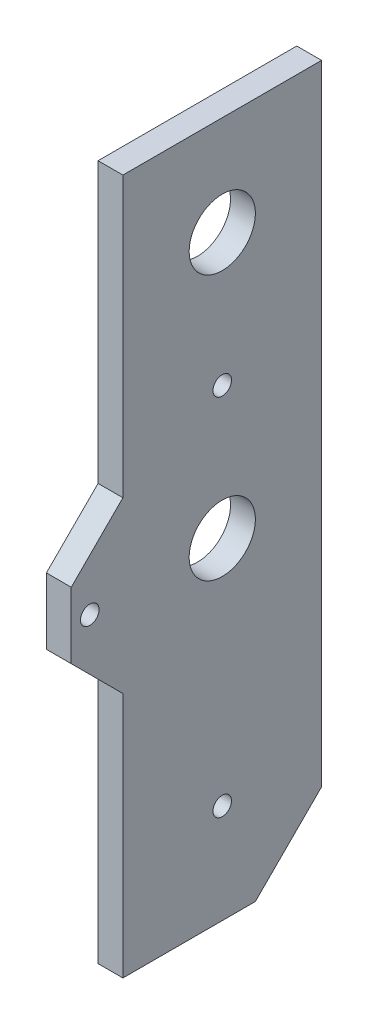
ISO-10303-21;
HEADER;
FILE_DESCRIPTION(('STEP AP214'),'2;1');
FILE_NAME('part.step','',(''),(''),'','','');
FILE_SCHEMA(('AUTOMOTIVE_DESIGN { 1 0 10303 214 1 1 1 1 }'));
ENDSEC;
DATA;
#1=APPLICATION_CONTEXT('core data for automotive mechanical design processes');
#2=APPLICATION_PROTOCOL_DEFINITION('international standard','automotive_design',2000,#1);
#3=PRODUCT_CONTEXT('',#1,'mechanical');
#4=PRODUCT('Part','Part','',(#3));
#5=PRODUCT_RELATED_PRODUCT_CATEGORY('part','',(#4));
#6=PRODUCT_DEFINITION_FORMATION('','',#4);
#7=PRODUCT_DEFINITION_CONTEXT('part definition',#1,'design');
#8=PRODUCT_DEFINITION('design','',#6,#7);
#9=PRODUCT_DEFINITION_SHAPE('','',#8);
#10=(LENGTH_UNIT() NAMED_UNIT(*) SI_UNIT(.MILLI.,.METRE.));
#11=(NAMED_UNIT(*) PLANE_ANGLE_UNIT() SI_UNIT($,.RADIAN.));
#12=(NAMED_UNIT(*) SI_UNIT($,.STERADIAN.) SOLID_ANGLE_UNIT());
#13=UNCERTAINTY_MEASURE_WITH_UNIT(LENGTH_MEASURE(1.E-05),#10,'distance_accuracy_value','');
#14=(GEOMETRIC_REPRESENTATION_CONTEXT(3) GLOBAL_UNCERTAINTY_ASSIGNED_CONTEXT((#13)) GLOBAL_UNIT_ASSIGNED_CONTEXT((#10,
#11,#12)) REPRESENTATION_CONTEXT('',''));
#15=CARTESIAN_POINT('',(0.,0.,0.));
#16=DIRECTION('',(0.,0.,1.));
#17=DIRECTION('',(1.,0.,0.));
#18=AXIS2_PLACEMENT_3D('',#15,#16,#17);
#19=CARTESIAN_POINT('',(4.7625,0.,0.));
#20=DIRECTION('',(1.,0.,0.));
#21=DIRECTION('',(0.,0.,-1.));
#22=AXIS2_PLACEMENT_3D('',#19,#20,#21);
#23=PLANE('',#22);
#24=CARTESIAN_POINT('',(4.7625,-1.97919458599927E-09,-2.22260629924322));
#25=DIRECTION('',(1.,0.,0.));
#26=DIRECTION('',(0.,0.,-1.));
#27=AXIS2_PLACEMENT_3D('',#24,#25,#26);
#28=CIRCLE('',#27,1.77799999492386);
#29=CARTESIAN_POINT('',(4.7625,-1.97919458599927E-09,-0.444606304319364));
#30=VERTEX_POINT('',#29);
#31=EDGE_CURVE('E214',#30,#30,#28,.T.);
#32=ORIENTED_EDGE('',*,*,#31,.F.);
#33=EDGE_LOOP('',(#32));
#34=FACE_BOUND('',#33,.T.);
#35=CARTESIAN_POINT('',(4.7625,50.7999999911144,-27.6226063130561));
#36=DIRECTION('',(1.,0.,0.));
#37=DIRECTION('',(0.,0.,-1.));
#38=AXIS2_PLACEMENT_3D('',#35,#36,#37);
#39=CIRCLE('',#38,6.34999999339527);
#40=CARTESIAN_POINT('',(4.7625,50.7999999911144,-21.2726063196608));
#41=VERTEX_POINT('',#40);
#42=EDGE_CURVE('E202',#41,#41,#39,.T.);
#43=ORIENTED_EDGE('',*,*,#42,.F.);
#44=EDGE_LOOP('',(#43));
#45=FACE_BOUND('',#44,.T.);
#46=DIRECTION('',(0.,-1.,2.71906559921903E-10));
#47=VECTOR('',#46,1.);
#48=CARTESIAN_POINT('',(4.7625,69.8499999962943,-8.57260631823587));
#49=LINE('',#48,#47);
#50=CARTESIAN_POINT('',(4.7625,69.8499999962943,-8.57260631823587));
#51=VERTEX_POINT('',#50);
#52=CARTESIAN_POINT('',(4.7625,16.2559999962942,-8.57260630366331));
#53=VERTEX_POINT('',#52);
#54=EDGE_CURVE('E157',#51,#53,#49,.T.);
#55=ORIENTED_EDGE('',*,*,#54,.T.);
#56=DIRECTION('',(0.,-0.70710678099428,0.707106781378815));
#57=VECTOR('',#56,1.);
#58=CARTESIAN_POINT('',(4.7625,16.2559999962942,-8.57260630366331));
#59=LINE('',#58,#57);
#60=CARTESIAN_POINT('',(4.7625,6.34999999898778,1.33339369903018));
#61=VERTEX_POINT('',#60);
#62=EDGE_CURVE('E100',#53,#61,#59,.T.);
#63=ORIENTED_EDGE('',*,*,#62,.T.);
#64=DIRECTION('',(0.,-1.,2.7190629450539E-10));
#65=VECTOR('',#64,1.);
#66=CARTESIAN_POINT('',(4.7625,6.34999999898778,1.33339369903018));
#67=LINE('',#66,#65);
#68=CARTESIAN_POINT('',(4.7625,-6.35000000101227,1.33339370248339));
#69=VERTEX_POINT('',#68);
#70=EDGE_CURVE('E175',#61,#69,#67,.T.);
#71=ORIENTED_EDGE('',*,*,#70,.T.);
#72=DIRECTION('',(0.,-0.707106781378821,-0.707106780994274));
#73=VECTOR('',#72,1.);
#74=CARTESIAN_POINT('',(4.7625,-6.35000000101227,1.33339370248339));
#75=LINE('',#74,#73);
#76=CARTESIAN_POINT('',(4.7625,-16.2560000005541,-8.57260629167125));
#77=VERTEX_POINT('',#76);
#78=EDGE_CURVE('E192',#69,#77,#75,.T.);
#79=ORIENTED_EDGE('',*,*,#78,.T.);
#80=DIRECTION('',(0.,-1.,2.60210834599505E-10));
#81=VECTOR('',#80,1.);
#82=CARTESIAN_POINT('',(4.7625,-63.5000000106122,-8.57260627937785));
#83=LINE('',#82,#81);
#84=CARTESIAN_POINT('',(4.7625,-63.5000000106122,-8.57260627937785));
#85=VERTEX_POINT('',#84);
#86=EDGE_CURVE('E191',#77,#85,#83,.T.);
#87=ORIENTED_EDGE('',*,*,#86,.T.);
#88=DIRECTION('',(0.,0.,-1.));
#89=VECTOR('',#88,1.);
#90=CARTESIAN_POINT('',(4.7625,-63.5000000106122,-8.57260627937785));
#91=LINE('',#90,#89);
#92=CARTESIAN_POINT('',(4.7625,-63.5000000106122,-33.9726062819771));
#93=VERTEX_POINT('',#92);
#94=EDGE_CURVE('E122',#85,#93,#91,.T.);
#95=ORIENTED_EDGE('',*,*,#94,.T.);
#96=DIRECTION('',(0.,0.70710678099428,-0.707106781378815));
#97=VECTOR('',#96,1.);
#98=CARTESIAN_POINT('',(4.7625,-50.8000000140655,-46.6726062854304));
#99=LINE('',#98,#97);
#100=CARTESIAN_POINT('',(4.7625,-50.8000000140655,-46.6726062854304));
#101=VERTEX_POINT('',#100);
#102=EDGE_CURVE('E116',#93,#101,#99,.T.);
#103=ORIENTED_EDGE('',*,*,#102,.T.);
#104=DIRECTION('',(0.,1.,-2.71906352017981E-10));
#105=VECTOR('',#104,1.);
#106=CARTESIAN_POINT('',(4.7625,69.8499999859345,-46.6726063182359));
#107=LINE('',#106,#105);
#108=CARTESIAN_POINT('',(4.7625,69.8499999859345,-46.6726063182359));
#109=VERTEX_POINT('',#108);
#110=EDGE_CURVE('E120',#101,#109,#107,.T.);
#111=ORIENTED_EDGE('',*,*,#110,.T.);
#112=DIRECTION('',(0.,2.71908479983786E-10,1.));
#113=VECTOR('',#112,1.);
#114=CARTESIAN_POINT('',(4.7625,69.8499999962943,-8.57260631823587));
#115=LINE('',#114,#113);
#116=EDGE_CURVE('E54',#109,#51,#115,.T.);
#117=ORIENTED_EDGE('',*,*,#116,.T.);
#118=EDGE_LOOP('',(#55,#63,#71,#79,#87,#95,#103,#111,#117));
#119=FACE_BOUND('',#118,.T.);
#120=CARTESIAN_POINT('',(4.7625,-8.88561446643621E-09,-27.6226062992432));
#121=DIRECTION('',(1.,0.,0.));
#122=DIRECTION('',(0.,0.,-1.));
#123=AXIS2_PLACEMENT_3D('',#120,#121,#122);
#124=CIRCLE('',#123,6.34999999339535);
#125=CARTESIAN_POINT('',(4.7625,-8.88561446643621E-09,-21.2726063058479));
#126=VERTEX_POINT('',#125);
#127=EDGE_CURVE('E144',#126,#126,#124,.T.);
#128=ORIENTED_EDGE('',*,*,#127,.F.);
#129=EDGE_LOOP('',(#128));
#130=FACE_BOUND('',#129,.T.);
#131=CARTESIAN_POINT('',(4.7625,-44.4500000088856,-27.622606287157));
#132=DIRECTION('',(1.,0.,0.));
#133=DIRECTION('',(0.,0.,-1.));
#134=AXIS2_PLACEMENT_3D('',#131,#132,#133);
#135=CIRCLE('',#134,1.77799999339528);
#136=CARTESIAN_POINT('',(4.7625,-44.4500000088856,-25.8446062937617));
#137=VERTEX_POINT('',#136);
#138=EDGE_CURVE('E208',#137,#137,#135,.T.);
#139=ORIENTED_EDGE('',*,*,#138,.F.);
#140=EDGE_LOOP('',(#139));
#141=FACE_BOUND('',#140,.T.);
#142=CARTESIAN_POINT('',(4.7625,25.3999999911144,-27.6226063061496));
#143=DIRECTION('',(1.,0.,0.));
#144=DIRECTION('',(0.,0.,-1.));
#145=AXIS2_PLACEMENT_3D('',#142,#143,#144);
#146=CIRCLE('',#145,1.77800000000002);
#147=CARTESIAN_POINT('',(4.7625,25.3999999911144,-25.8446063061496));
#148=VERTEX_POINT('',#147);
#149=EDGE_CURVE('E220',#148,#148,#146,.T.);
#150=ORIENTED_EDGE('',*,*,#149,.F.);
#151=EDGE_LOOP('',(#150));
#152=FACE_BOUND('',#151,.T.);
#153=ADVANCED_FACE('F37',(#34,#45,#119,#130,#141,#152),#23,.T.);
#154=CARTESIAN_POINT('',(0.,0.,0.));
#155=DIRECTION('',(1.,0.,0.));
#156=DIRECTION('',(0.,0.,-1.));
#157=AXIS2_PLACEMENT_3D('',#154,#155,#156);
#158=PLANE('',#157);
#159=DIRECTION('',(0.,-1.,2.71906559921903E-10));
#160=VECTOR('',#159,1.);
#161=CARTESIAN_POINT('',(0.,69.8499999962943,-8.57260631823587));
#162=LINE('',#161,#160);
#163=CARTESIAN_POINT('',(0.,69.8499999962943,-8.57260631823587));
#164=VERTEX_POINT('',#163);
#165=CARTESIAN_POINT('',(0.,16.2559999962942,-8.57260630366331));
#166=VERTEX_POINT('',#165);
#167=EDGE_CURVE('E140',#164,#166,#162,.T.);
#168=ORIENTED_EDGE('',*,*,#167,.F.);
#169=DIRECTION('',(0.,2.71908479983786E-10,1.));
#170=VECTOR('',#169,1.);
#171=CARTESIAN_POINT('',(0.,69.8499999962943,-8.57260631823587));
#172=LINE('',#171,#170);
#173=CARTESIAN_POINT('',(0.,69.8499999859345,-46.6726063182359));
#174=VERTEX_POINT('',#173);
#175=EDGE_CURVE('E92',#174,#164,#172,.T.);
#176=ORIENTED_EDGE('',*,*,#175,.F.);
#177=DIRECTION('',(0.,1.,-2.71906352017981E-10));
#178=VECTOR('',#177,1.);
#179=CARTESIAN_POINT('',(0.,69.8499999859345,-46.6726063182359));
#180=LINE('',#179,#178);
#181=CARTESIAN_POINT('',(0.,-50.8000000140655,-46.6726062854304));
#182=VERTEX_POINT('',#181);
#183=EDGE_CURVE('E86',#182,#174,#180,.T.);
#184=ORIENTED_EDGE('',*,*,#183,.F.);
#185=DIRECTION('',(0.,0.70710678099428,-0.707106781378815));
#186=VECTOR('',#185,1.);
#187=CARTESIAN_POINT('',(0.,-50.8000000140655,-46.6726062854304));
#188=LINE('',#187,#186);
#189=CARTESIAN_POINT('',(0.,-63.5000000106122,-33.9726062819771));
#190=VERTEX_POINT('',#189);
#191=EDGE_CURVE('E130',#190,#182,#188,.T.);
#192=ORIENTED_EDGE('',*,*,#191,.F.);
#193=DIRECTION('',(0.,0.,-1.));
#194=VECTOR('',#193,1.);
#195=CARTESIAN_POINT('',(0.,-63.5000000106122,-8.57260627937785));
#196=LINE('',#195,#194);
#197=CARTESIAN_POINT('',(0.,-63.5000000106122,-8.57260627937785));
#198=VERTEX_POINT('',#197);
#199=EDGE_CURVE('E152',#198,#190,#196,.T.);
#200=ORIENTED_EDGE('',*,*,#199,.F.);
#201=DIRECTION('',(0.,-1.,2.60210834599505E-10));
#202=VECTOR('',#201,1.);
#203=CARTESIAN_POINT('',(0.,-63.5000000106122,-8.57260627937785));
#204=LINE('',#203,#202);
#205=CARTESIAN_POINT('',(0.,-16.2560000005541,-8.57260629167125));
#206=VERTEX_POINT('',#205);
#207=EDGE_CURVE('E150',#206,#198,#204,.T.);
#208=ORIENTED_EDGE('',*,*,#207,.F.);
#209=DIRECTION('',(0.,-0.707106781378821,-0.707106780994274));
#210=VECTOR('',#209,1.);
#211=CARTESIAN_POINT('',(0.,-6.35000000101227,1.33339370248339));
#212=LINE('',#211,#210);
#213=CARTESIAN_POINT('',(0.,-6.35000000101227,1.33339370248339));
#214=VERTEX_POINT('',#213);
#215=EDGE_CURVE('E148',#214,#206,#212,.T.);
#216=ORIENTED_EDGE('',*,*,#215,.F.);
#217=DIRECTION('',(0.,-1.,2.7190629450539E-10));
#218=VECTOR('',#217,1.);
#219=CARTESIAN_POINT('',(0.,6.34999999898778,1.33339369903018));
#220=LINE('',#219,#218);
#221=CARTESIAN_POINT('',(0.,6.34999999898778,1.33339369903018));
#222=VERTEX_POINT('',#221);
#223=EDGE_CURVE('E146',#222,#214,#220,.T.);
#224=ORIENTED_EDGE('',*,*,#223,.F.);
#225=DIRECTION('',(0.,-0.70710678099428,0.707106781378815));
#226=VECTOR('',#225,1.);
#227=CARTESIAN_POINT('',(0.,16.2559999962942,-8.57260630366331));
#228=LINE('',#227,#226);
#229=EDGE_CURVE('E143',#166,#222,#228,.T.);
#230=ORIENTED_EDGE('',*,*,#229,.F.);
#231=EDGE_LOOP('',(#168,#176,#184,#192,#200,#208,#216,#224,#230));
#232=FACE_BOUND('',#231,.T.);
#233=CARTESIAN_POINT('',(0.,-8.88561446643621E-09,-27.6226062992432));
#234=DIRECTION('',(1.,0.,0.));
#235=DIRECTION('',(0.,0.,-1.));
#236=AXIS2_PLACEMENT_3D('',#233,#234,#235);
#237=CIRCLE('',#236,6.34999999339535);
#238=CARTESIAN_POINT('',(0.,-8.88561446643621E-09,-21.2726063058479));
#239=VERTEX_POINT('',#238);
#240=EDGE_CURVE('E199',#239,#239,#237,.T.);
#241=ORIENTED_EDGE('',*,*,#240,.T.);
#242=EDGE_LOOP('',(#241));
#243=FACE_BOUND('',#242,.T.);
#244=CARTESIAN_POINT('',(0.,50.7999999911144,-27.6226063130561));
#245=DIRECTION('',(1.,0.,0.));
#246=DIRECTION('',(0.,0.,-1.));
#247=AXIS2_PLACEMENT_3D('',#244,#245,#246);
#248=CIRCLE('',#247,6.34999999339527);
#249=CARTESIAN_POINT('',(0.,50.7999999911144,-21.2726063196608));
#250=VERTEX_POINT('',#249);
#251=EDGE_CURVE('E205',#250,#250,#248,.T.);
#252=ORIENTED_EDGE('',*,*,#251,.T.);
#253=EDGE_LOOP('',(#252));
#254=FACE_BOUND('',#253,.T.);
#255=CARTESIAN_POINT('',(0.,-44.4500000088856,-27.622606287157));
#256=DIRECTION('',(1.,0.,0.));
#257=DIRECTION('',(0.,0.,-1.));
#258=AXIS2_PLACEMENT_3D('',#255,#256,#257);
#259=CIRCLE('',#258,1.77799999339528);
#260=CARTESIAN_POINT('',(0.,-44.4500000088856,-25.8446062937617));
#261=VERTEX_POINT('',#260);
#262=EDGE_CURVE('E211',#261,#261,#259,.T.);
#263=ORIENTED_EDGE('',*,*,#262,.T.);
#264=EDGE_LOOP('',(#263));
#265=FACE_BOUND('',#264,.T.);
#266=CARTESIAN_POINT('',(0.,-1.97919458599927E-09,-2.22260629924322));
#267=DIRECTION('',(1.,0.,0.));
#268=DIRECTION('',(0.,0.,-1.));
#269=AXIS2_PLACEMENT_3D('',#266,#267,#268);
#270=CIRCLE('',#269,1.77799999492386);
#271=CARTESIAN_POINT('',(0.,-1.97919458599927E-09,-0.444606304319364));
#272=VERTEX_POINT('',#271);
#273=EDGE_CURVE('E217',#272,#272,#270,.T.);
#274=ORIENTED_EDGE('',*,*,#273,.T.);
#275=EDGE_LOOP('',(#274));
#276=FACE_BOUND('',#275,.T.);
#277=CARTESIAN_POINT('',(0.,25.3999999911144,-27.6226063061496));
#278=DIRECTION('',(1.,0.,0.));
#279=DIRECTION('',(0.,0.,-1.));
#280=AXIS2_PLACEMENT_3D('',#277,#278,#279);
#281=CIRCLE('',#280,1.77800000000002);
#282=CARTESIAN_POINT('',(0.,25.3999999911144,-25.8446063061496));
#283=VERTEX_POINT('',#282);
#284=EDGE_CURVE('E223',#283,#283,#281,.T.);
#285=ORIENTED_EDGE('',*,*,#284,.T.);
#286=EDGE_LOOP('',(#285));
#287=FACE_BOUND('',#286,.T.);
#288=ADVANCED_FACE('F179',(#232,#243,#254,#265,#276,#287),#158,.F.);
#289=CARTESIAN_POINT('',(4.7625,69.8499999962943,-8.57260631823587));
#290=DIRECTION('',(0.,-2.71906559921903E-10,-1.));
#291=DIRECTION('',(0.,1.,-2.71906559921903E-10));
#292=AXIS2_PLACEMENT_3D('',#289,#290,#291);
#293=PLANE('',#292);
#294=ORIENTED_EDGE('',*,*,#167,.T.);
#295=DIRECTION('',(-1.,0.,0.));
#296=VECTOR('',#295,1.);
#297=CARTESIAN_POINT('',(4.7625,16.2559999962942,-8.57260630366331));
#298=LINE('',#297,#296);
#299=EDGE_CURVE('E11',#53,#166,#298,.T.);
#300=ORIENTED_EDGE('',*,*,#299,.F.);
#301=ORIENTED_EDGE('',*,*,#54,.F.);
#302=DIRECTION('',(-1.,0.,0.));
#303=VECTOR('',#302,1.);
#304=CARTESIAN_POINT('',(4.7625,69.8499999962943,-8.57260631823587));
#305=LINE('',#304,#303);
#306=EDGE_CURVE('E136',#51,#164,#305,.T.);
#307=ORIENTED_EDGE('',*,*,#306,.T.);
#308=EDGE_LOOP('',(#294,#300,#301,#307));
#309=FACE_BOUND('',#308,.T.);
#310=ADVANCED_FACE('F39',(#309),#293,.F.);
#311=CARTESIAN_POINT('',(4.7625,16.2559999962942,-8.57260630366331));
#312=DIRECTION('',(0.,-0.707106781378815,-0.70710678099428));
#313=DIRECTION('',(0.,0.70710678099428,-0.707106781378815));
#314=AXIS2_PLACEMENT_3D('',#311,#312,#313);
#315=PLANE('',#314);
#316=ORIENTED_EDGE('',*,*,#229,.T.);
#317=DIRECTION('',(-1.,0.,0.));
#318=VECTOR('',#317,1.);
#319=CARTESIAN_POINT('',(4.7625,6.34999999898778,1.33339369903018));
#320=LINE('',#319,#318);
#321=EDGE_CURVE('E46',#61,#222,#320,.T.);
#322=ORIENTED_EDGE('',*,*,#321,.F.);
#323=ORIENTED_EDGE('',*,*,#62,.F.);
#324=ORIENTED_EDGE('',*,*,#299,.T.);
#325=EDGE_LOOP('',(#316,#322,#323,#324));
#326=FACE_BOUND('',#325,.T.);
#327=ADVANCED_FACE('F261',(#326),#315,.F.);
#328=CARTESIAN_POINT('',(4.7625,6.34999999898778,1.33339369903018));
#329=DIRECTION('',(0.,-2.71906294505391E-10,-1.));
#330=DIRECTION('',(0.,1.,-2.71906294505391E-10));
#331=AXIS2_PLACEMENT_3D('',#328,#329,#330);
#332=PLANE('',#331);
#333=ORIENTED_EDGE('',*,*,#223,.T.);
#334=DIRECTION('',(-1.,0.,0.));
#335=VECTOR('',#334,1.);
#336=CARTESIAN_POINT('',(4.7625,-6.35000000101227,1.33339370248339));
#337=LINE('',#336,#335);
#338=EDGE_CURVE('E167',#69,#214,#337,.T.);
#339=ORIENTED_EDGE('',*,*,#338,.F.);
#340=ORIENTED_EDGE('',*,*,#70,.F.);
#341=ORIENTED_EDGE('',*,*,#321,.T.);
#342=EDGE_LOOP('',(#333,#339,#340,#341));
#343=FACE_BOUND('',#342,.T.);
#344=ADVANCED_FACE('F173',(#343),#332,.F.);
#345=CARTESIAN_POINT('',(4.7625,-6.35000000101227,1.33339370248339));
#346=DIRECTION('',(0.,0.707106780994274,-0.707106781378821));
#347=DIRECTION('',(0.,0.707106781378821,0.707106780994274));
#348=AXIS2_PLACEMENT_3D('',#345,#346,#347);
#349=PLANE('',#348);
#350=ORIENTED_EDGE('',*,*,#215,.T.);
#351=DIRECTION('',(-1.,0.,0.));
#352=VECTOR('',#351,1.);
#353=CARTESIAN_POINT('',(4.7625,-16.2560000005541,-8.57260629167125));
#354=LINE('',#353,#352);
#355=EDGE_CURVE('E164',#77,#206,#354,.T.);
#356=ORIENTED_EDGE('',*,*,#355,.F.);
#357=ORIENTED_EDGE('',*,*,#78,.F.);
#358=ORIENTED_EDGE('',*,*,#338,.T.);
#359=EDGE_LOOP('',(#350,#356,#357,#358));
#360=FACE_BOUND('',#359,.T.);
#361=ADVANCED_FACE('F185',(#360),#349,.F.);
#362=CARTESIAN_POINT('',(4.7625,-63.5000000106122,-8.57260627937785));
#363=DIRECTION('',(0.,-2.60210834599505E-10,-1.));
#364=DIRECTION('',(0.,1.,-2.60210834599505E-10));
#365=AXIS2_PLACEMENT_3D('',#362,#363,#364);
#366=PLANE('',#365);
#367=ORIENTED_EDGE('',*,*,#207,.T.);
#368=DIRECTION('',(-1.,0.,0.));
#369=VECTOR('',#368,1.);
#370=CARTESIAN_POINT('',(4.7625,-63.5000000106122,-8.57260627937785));
#371=LINE('',#370,#369);
#372=EDGE_CURVE('E161',#85,#198,#371,.T.);
#373=ORIENTED_EDGE('',*,*,#372,.F.);
#374=ORIENTED_EDGE('',*,*,#86,.F.);
#375=ORIENTED_EDGE('',*,*,#355,.T.);
#376=EDGE_LOOP('',(#367,#373,#374,#375));
#377=FACE_BOUND('',#376,.T.);
#378=ADVANCED_FACE('F189',(#377),#366,.F.);
#379=CARTESIAN_POINT('',(4.7625,-63.5000000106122,-8.57260627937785));
#380=DIRECTION('',(0.,1.,0.));
#381=DIRECTION('',(0.,0.,1.));
#382=AXIS2_PLACEMENT_3D('',#379,#380,#381);
#383=PLANE('',#382);
#384=ORIENTED_EDGE('',*,*,#199,.T.);
#385=DIRECTION('',(-1.,0.,0.));
#386=VECTOR('',#385,1.);
#387=CARTESIAN_POINT('',(4.7625,-63.5000000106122,-33.9726062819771));
#388=LINE('',#387,#386);
#389=EDGE_CURVE('E131',#93,#190,#388,.T.);
#390=ORIENTED_EDGE('',*,*,#389,.F.);
#391=ORIENTED_EDGE('',*,*,#94,.F.);
#392=ORIENTED_EDGE('',*,*,#372,.T.);
#393=EDGE_LOOP('',(#384,#390,#391,#392));
#394=FACE_BOUND('',#393,.T.);
#395=ADVANCED_FACE('F252',(#394),#383,.F.);
#396=CARTESIAN_POINT('',(4.7625,-50.8000000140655,-46.6726062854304));
#397=DIRECTION('',(0.,0.707106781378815,0.70710678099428));
#398=DIRECTION('',(0.,-0.70710678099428,0.707106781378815));
#399=AXIS2_PLACEMENT_3D('',#396,#397,#398);
#400=PLANE('',#399);
#401=ORIENTED_EDGE('',*,*,#191,.T.);
#402=DIRECTION('',(-1.,0.,0.));
#403=VECTOR('',#402,1.);
#404=CARTESIAN_POINT('',(4.7625,-50.8000000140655,-46.6726062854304));
#405=LINE('',#404,#403);
#406=EDGE_CURVE('E127',#101,#182,#405,.T.);
#407=ORIENTED_EDGE('',*,*,#406,.F.);
#408=ORIENTED_EDGE('',*,*,#102,.F.);
#409=ORIENTED_EDGE('',*,*,#389,.T.);
#410=EDGE_LOOP('',(#401,#407,#408,#409));
#411=FACE_BOUND('',#410,.T.);
#412=ADVANCED_FACE('F128',(#411),#400,.F.);
#413=CARTESIAN_POINT('',(4.7625,69.8499999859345,-46.6726063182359));
#414=DIRECTION('',(0.,2.71906352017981E-10,1.));
#415=DIRECTION('',(0.,-1.,2.71906352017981E-10));
#416=AXIS2_PLACEMENT_3D('',#413,#414,#415);
#417=PLANE('',#416);
#418=ORIENTED_EDGE('',*,*,#183,.T.);
#419=DIRECTION('',(-1.,0.,0.));
#420=VECTOR('',#419,1.);
#421=CARTESIAN_POINT('',(4.7625,69.8499999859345,-46.6726063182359));
#422=LINE('',#421,#420);
#423=EDGE_CURVE('E132',#109,#174,#422,.T.);
#424=ORIENTED_EDGE('',*,*,#423,.F.);
#425=ORIENTED_EDGE('',*,*,#110,.F.);
#426=ORIENTED_EDGE('',*,*,#406,.T.);
#427=EDGE_LOOP('',(#418,#424,#425,#426));
#428=FACE_BOUND('',#427,.T.);
#429=ADVANCED_FACE('F134',(#428),#417,.F.);
#430=CARTESIAN_POINT('',(4.7625,69.8499999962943,-8.57260631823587));
#431=DIRECTION('',(0.,-1.,2.71908479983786E-10));
#432=DIRECTION('',(0.,-2.71908479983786E-10,-1.));
#433=AXIS2_PLACEMENT_3D('',#430,#431,#432);
#434=PLANE('',#433);
#435=ORIENTED_EDGE('',*,*,#175,.T.);
#436=ORIENTED_EDGE('',*,*,#306,.F.);
#437=ORIENTED_EDGE('',*,*,#116,.F.);
#438=ORIENTED_EDGE('',*,*,#423,.T.);
#439=EDGE_LOOP('',(#435,#436,#437,#438));
#440=FACE_BOUND('',#439,.T.);
#441=ADVANCED_FACE('F245',(#440),#434,.F.);
#442=CARTESIAN_POINT('',(4.7625,-8.88561446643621E-09,-27.6226062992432));
#443=DIRECTION('',(-1.,0.,0.));
#444=DIRECTION('',(0.,0.,1.));
#445=AXIS2_PLACEMENT_3D('',#442,#443,#444);
#446=CYLINDRICAL_SURFACE('',#445,6.34999999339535);
#447=CARTESIAN_POINT('',(4.7625,-8.88561446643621E-09,-21.2726063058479));
#448=CARTESIAN_POINT('',(4.712890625,-8.88561446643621E-09,-21.2726063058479));
#449=CARTESIAN_POINT('',(4.66328125,-8.88561446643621E-09,-21.2726063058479));
#450=CARTESIAN_POINT('',(4.5640625,-8.88561446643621E-09,-21.2726063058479));
#451=CARTESIAN_POINT('',(4.514453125,-8.88561446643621E-09,-21.2726063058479));
#452=CARTESIAN_POINT('',(4.415234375,-8.88561446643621E-09,-21.2726063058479));
#453=CARTESIAN_POINT('',(4.365625,-8.88561446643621E-09,-21.2726063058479));
#454=CARTESIAN_POINT('',(4.26640625,-8.88561446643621E-09,-21.2726063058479));
#455=CARTESIAN_POINT('',(4.216796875,-8.88561446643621E-09,-21.2726063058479));
#456=CARTESIAN_POINT('',(4.117578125,-8.88561446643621E-09,-21.2726063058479));
#457=CARTESIAN_POINT('',(4.06796875,-8.88561446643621E-09,-21.2726063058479));
#458=CARTESIAN_POINT('',(3.96875,-8.88561446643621E-09,-21.2726063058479));
#459=CARTESIAN_POINT('',(3.919140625,-8.88561446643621E-09,-21.2726063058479));
#460=CARTESIAN_POINT('',(3.819921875,-8.88561446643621E-09,-21.2726063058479));
#461=CARTESIAN_POINT('',(3.7703125,-8.88561446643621E-09,-21.2726063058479));
#462=CARTESIAN_POINT('',(3.67109375,-8.88561446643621E-09,-21.2726063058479));
#463=CARTESIAN_POINT('',(3.621484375,-8.88561446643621E-09,-21.2726063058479));
#464=CARTESIAN_POINT('',(3.522265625,-8.88561446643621E-09,-21.2726063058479));
#465=CARTESIAN_POINT('',(3.47265625,-8.88561446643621E-09,-21.2726063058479));
#466=CARTESIAN_POINT('',(3.3734375,-8.88561446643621E-09,-21.2726063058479));
#467=CARTESIAN_POINT('',(3.323828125,-8.88561446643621E-09,-21.2726063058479));
#468=CARTESIAN_POINT('',(3.224609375,-8.88561446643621E-09,-21.2726063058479));
#469=CARTESIAN_POINT('',(3.175,-8.88561446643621E-09,-21.2726063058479));
#470=CARTESIAN_POINT('',(3.07578125,-8.88561446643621E-09,-21.2726063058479));
#471=CARTESIAN_POINT('',(3.026171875,-8.88561446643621E-09,-21.2726063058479));
#472=CARTESIAN_POINT('',(2.926953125,-8.88561446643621E-09,-21.2726063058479));
#473=CARTESIAN_POINT('',(2.87734375,-8.88561446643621E-09,-21.2726063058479));
#474=CARTESIAN_POINT('',(2.778125,-8.88561446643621E-09,-21.2726063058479));
#475=CARTESIAN_POINT('',(2.728515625,-8.88561446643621E-09,-21.2726063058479));
#476=CARTESIAN_POINT('',(2.629296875,-8.88561446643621E-09,-21.2726063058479));
#477=CARTESIAN_POINT('',(2.5796875,-8.88561446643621E-09,-21.2726063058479));
#478=CARTESIAN_POINT('',(2.48046875,-8.88561446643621E-09,-21.2726063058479));
#479=CARTESIAN_POINT('',(2.430859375,-8.88561446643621E-09,-21.2726063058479));
#480=CARTESIAN_POINT('',(2.331640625,-8.88561446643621E-09,-21.2726063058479));
#481=CARTESIAN_POINT('',(2.28203125,-8.88561446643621E-09,-21.2726063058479));
#482=CARTESIAN_POINT('',(2.1828125,-8.88561446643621E-09,-21.2726063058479));
#483=CARTESIAN_POINT('',(2.133203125,-8.88561446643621E-09,-21.2726063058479));
#484=CARTESIAN_POINT('',(2.033984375,-8.88561446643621E-09,-21.2726063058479));
#485=CARTESIAN_POINT('',(1.984375,-8.88561446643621E-09,-21.2726063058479));
#486=CARTESIAN_POINT('',(1.88515625,-8.88561446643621E-09,-21.2726063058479));
#487=CARTESIAN_POINT('',(1.835546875,-8.88561446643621E-09,-21.2726063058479));
#488=CARTESIAN_POINT('',(1.736328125,-8.88561446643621E-09,-21.2726063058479));
#489=CARTESIAN_POINT('',(1.68671875,-8.88561446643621E-09,-21.2726063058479));
#490=CARTESIAN_POINT('',(1.5875,-8.88561446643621E-09,-21.2726063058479));
#491=CARTESIAN_POINT('',(1.537890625,-8.88561446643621E-09,-21.2726063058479));
#492=CARTESIAN_POINT('',(1.438671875,-8.88561446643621E-09,-21.2726063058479));
#493=CARTESIAN_POINT('',(1.3890625,-8.88561446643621E-09,-21.2726063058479));
#494=CARTESIAN_POINT('',(1.28984375,-8.88561446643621E-09,-21.2726063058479));
#495=CARTESIAN_POINT('',(1.240234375,-8.88561446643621E-09,-21.2726063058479));
#496=CARTESIAN_POINT('',(1.141015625,-8.88561446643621E-09,-21.2726063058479));
#497=CARTESIAN_POINT('',(1.09140625,-8.88561446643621E-09,-21.2726063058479));
#498=CARTESIAN_POINT('',(0.992187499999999,-8.88561446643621E-09,-21.2726063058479));
#499=CARTESIAN_POINT('',(0.942578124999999,-8.88561446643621E-09,-21.2726063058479));
#500=CARTESIAN_POINT('',(0.843359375,-8.88561446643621E-09,-21.2726063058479));
#501=CARTESIAN_POINT('',(0.79375,-8.88561446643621E-09,-21.2726063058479));
#502=CARTESIAN_POINT('',(0.69453125,-8.88561446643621E-09,-21.2726063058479));
#503=CARTESIAN_POINT('',(0.644921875,-8.88561446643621E-09,-21.2726063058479));
#504=CARTESIAN_POINT('',(0.545703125,-8.88561446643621E-09,-21.2726063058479));
#505=CARTESIAN_POINT('',(0.49609375,-8.88561446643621E-09,-21.2726063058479));
#506=CARTESIAN_POINT('',(0.396875,-8.88561446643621E-09,-21.2726063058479));
#507=CARTESIAN_POINT('',(0.347265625,-8.88561446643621E-09,-21.2726063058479));
#508=CARTESIAN_POINT('',(0.248046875,-8.88561446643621E-09,-21.2726063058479));
#509=CARTESIAN_POINT('',(0.1984375,-8.88561446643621E-09,-21.2726063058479));
#510=CARTESIAN_POINT('',(0.09921875,-8.88561446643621E-09,-21.2726063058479));
#511=CARTESIAN_POINT('',(0.049609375,-8.88561446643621E-09,-21.2726063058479));
#512=CARTESIAN_POINT('',(0.,-8.88561446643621E-09,-21.2726063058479));
#513=B_SPLINE_CURVE_WITH_KNOTS('',3,(#447,#448,#449,#450,#451,#452,#453,#454,#455,#456,#457,
#458,#459,#460,#461,#462,#463,#464,#465,#466,#467,#468,#469,#470,#471,#472,#473,#474,#475,#476,
#477,#478,#479,#480,#481,#482,#483,#484,#485,#486,#487,#488,#489,#490,#491,#492,#493,#494,#495,
#496,#497,#498,#499,#500,#501,#502,#503,#504,#505,#506,#507,#508,#509,#510,#511,#512),
.UNSPECIFIED.,.F.,.F.,(4,2,2,2,2,2,2,2,2,2,2,2,2,2,2,2,2,2,2,2,2,2,2,2,2,2,2,2,2,2,2,2,4),(0.,
0.148828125,0.29765625,0.446484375,0.5953125,0.744140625,0.892968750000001,1.041796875,1.190625,
1.339453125,1.48828125,1.637109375,1.7859375,1.934765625,2.08359375,2.232421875,2.38125,
2.530078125,2.67890625,2.827734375,2.9765625,3.125390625,3.27421875,3.423046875,3.571875,
3.720703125,3.86953125,4.018359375,4.1671875,4.316015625,4.46484375,4.613671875,4.7625),.UNSPECIFIED.);
#514=EDGE_CURVE('BSEAM242',#126,#239,#513,.T.);
#515=ORIENTED_EDGE('',*,*,#127,.T.);
#516=ORIENTED_EDGE('',*,*,#240,.F.);
#517=ORIENTED_EDGE('',*,*,#514,.T.);
#518=ORIENTED_EDGE('',*,*,#514,.F.);
#519=EDGE_LOOP('',(#515,#517,#516,#518));
#520=FACE_BOUND('',#519,.T.);
#521=ADVANCED_FACE('F242',(#520),#446,.F.);
#522=CARTESIAN_POINT('',(4.7625,50.7999999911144,-27.6226063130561));
#523=DIRECTION('',(-1.,0.,0.));
#524=DIRECTION('',(0.,0.,1.));
#525=AXIS2_PLACEMENT_3D('',#522,#523,#524);
#526=CYLINDRICAL_SURFACE('',#525,6.34999999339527);
#527=CARTESIAN_POINT('',(4.7625,50.7999999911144,-21.2726063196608));
#528=CARTESIAN_POINT('',(4.712890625,50.7999999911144,-21.2726063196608));
#529=CARTESIAN_POINT('',(4.66328125,50.7999999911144,-21.2726063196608));
#530=CARTESIAN_POINT('',(4.5640625,50.7999999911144,-21.2726063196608));
#531=CARTESIAN_POINT('',(4.514453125,50.7999999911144,-21.2726063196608));
#532=CARTESIAN_POINT('',(4.415234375,50.7999999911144,-21.2726063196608));
#533=CARTESIAN_POINT('',(4.365625,50.7999999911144,-21.2726063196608));
#534=CARTESIAN_POINT('',(4.26640625,50.7999999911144,-21.2726063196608));
#535=CARTESIAN_POINT('',(4.216796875,50.7999999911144,-21.2726063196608));
#536=CARTESIAN_POINT('',(4.117578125,50.7999999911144,-21.2726063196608));
#537=CARTESIAN_POINT('',(4.06796875,50.7999999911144,-21.2726063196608));
#538=CARTESIAN_POINT('',(3.96875,50.7999999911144,-21.2726063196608));
#539=CARTESIAN_POINT('',(3.919140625,50.7999999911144,-21.2726063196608));
#540=CARTESIAN_POINT('',(3.819921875,50.7999999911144,-21.2726063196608));
#541=CARTESIAN_POINT('',(3.7703125,50.7999999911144,-21.2726063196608));
#542=CARTESIAN_POINT('',(3.67109375,50.7999999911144,-21.2726063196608));
#543=CARTESIAN_POINT('',(3.621484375,50.7999999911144,-21.2726063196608));
#544=CARTESIAN_POINT('',(3.522265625,50.7999999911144,-21.2726063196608));
#545=CARTESIAN_POINT('',(3.47265625,50.7999999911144,-21.2726063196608));
#546=CARTESIAN_POINT('',(3.3734375,50.7999999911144,-21.2726063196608));
#547=CARTESIAN_POINT('',(3.323828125,50.7999999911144,-21.2726063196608));
#548=CARTESIAN_POINT('',(3.224609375,50.7999999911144,-21.2726063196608));
#549=CARTESIAN_POINT('',(3.175,50.7999999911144,-21.2726063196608));
#550=CARTESIAN_POINT('',(3.07578125,50.7999999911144,-21.2726063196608));
#551=CARTESIAN_POINT('',(3.026171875,50.7999999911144,-21.2726063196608));
#552=CARTESIAN_POINT('',(2.926953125,50.7999999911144,-21.2726063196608));
#553=CARTESIAN_POINT('',(2.87734375,50.7999999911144,-21.2726063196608));
#554=CARTESIAN_POINT('',(2.778125,50.7999999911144,-21.2726063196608));
#555=CARTESIAN_POINT('',(2.728515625,50.7999999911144,-21.2726063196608));
#556=CARTESIAN_POINT('',(2.629296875,50.7999999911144,-21.2726063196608));
#557=CARTESIAN_POINT('',(2.5796875,50.7999999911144,-21.2726063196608));
#558=CARTESIAN_POINT('',(2.48046875,50.7999999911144,-21.2726063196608));
#559=CARTESIAN_POINT('',(2.430859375,50.7999999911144,-21.2726063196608));
#560=CARTESIAN_POINT('',(2.331640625,50.7999999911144,-21.2726063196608));
#561=CARTESIAN_POINT('',(2.28203125,50.7999999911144,-21.2726063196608));
#562=CARTESIAN_POINT('',(2.1828125,50.7999999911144,-21.2726063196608));
#563=CARTESIAN_POINT('',(2.133203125,50.7999999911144,-21.2726063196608));
#564=CARTESIAN_POINT('',(2.033984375,50.7999999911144,-21.2726063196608));
#565=CARTESIAN_POINT('',(1.984375,50.7999999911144,-21.2726063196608));
#566=CARTESIAN_POINT('',(1.88515625,50.7999999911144,-21.2726063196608));
#567=CARTESIAN_POINT('',(1.835546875,50.7999999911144,-21.2726063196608));
#568=CARTESIAN_POINT('',(1.736328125,50.7999999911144,-21.2726063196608));
#569=CARTESIAN_POINT('',(1.68671875,50.7999999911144,-21.2726063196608));
#570=CARTESIAN_POINT('',(1.5875,50.7999999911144,-21.2726063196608));
#571=CARTESIAN_POINT('',(1.537890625,50.7999999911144,-21.2726063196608));
#572=CARTESIAN_POINT('',(1.438671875,50.7999999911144,-21.2726063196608));
#573=CARTESIAN_POINT('',(1.3890625,50.7999999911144,-21.2726063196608));
#574=CARTESIAN_POINT('',(1.28984375,50.7999999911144,-21.2726063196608));
#575=CARTESIAN_POINT('',(1.240234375,50.7999999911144,-21.2726063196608));
#576=CARTESIAN_POINT('',(1.141015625,50.7999999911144,-21.2726063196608));
#577=CARTESIAN_POINT('',(1.09140625,50.7999999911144,-21.2726063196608));
#578=CARTESIAN_POINT('',(0.992187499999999,50.7999999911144,-21.2726063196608));
#579=CARTESIAN_POINT('',(0.942578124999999,50.7999999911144,-21.2726063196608));
#580=CARTESIAN_POINT('',(0.843359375,50.7999999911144,-21.2726063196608));
#581=CARTESIAN_POINT('',(0.79375,50.7999999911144,-21.2726063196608));
#582=CARTESIAN_POINT('',(0.69453125,50.7999999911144,-21.2726063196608));
#583=CARTESIAN_POINT('',(0.644921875,50.7999999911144,-21.2726063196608));
#584=CARTESIAN_POINT('',(0.545703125,50.7999999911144,-21.2726063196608));
#585=CARTESIAN_POINT('',(0.49609375,50.7999999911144,-21.2726063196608));
#586=CARTESIAN_POINT('',(0.396875,50.7999999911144,-21.2726063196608));
#587=CARTESIAN_POINT('',(0.347265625,50.7999999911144,-21.2726063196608));
#588=CARTESIAN_POINT('',(0.248046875,50.7999999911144,-21.2726063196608));
#589=CARTESIAN_POINT('',(0.1984375,50.7999999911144,-21.2726063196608));
#590=CARTESIAN_POINT('',(0.09921875,50.7999999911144,-21.2726063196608));
#591=CARTESIAN_POINT('',(0.049609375,50.7999999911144,-21.2726063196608));
#592=CARTESIAN_POINT('',(0.,50.7999999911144,-21.2726063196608));
#593=B_SPLINE_CURVE_WITH_KNOTS('',3,(#527,#528,#529,#530,#531,#532,#533,#534,#535,#536,#537,
#538,#539,#540,#541,#542,#543,#544,#545,#546,#547,#548,#549,#550,#551,#552,#553,#554,#555,#556,
#557,#558,#559,#560,#561,#562,#563,#564,#565,#566,#567,#568,#569,#570,#571,#572,#573,#574,#575,
#576,#577,#578,#579,#580,#581,#582,#583,#584,#585,#586,#587,#588,#589,#590,#591,#592),
.UNSPECIFIED.,.F.,.F.,(4,2,2,2,2,2,2,2,2,2,2,2,2,2,2,2,2,2,2,2,2,2,2,2,2,2,2,2,2,2,2,2,4),(0.,
0.148828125,0.29765625,0.446484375,0.5953125,0.744140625,0.892968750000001,1.041796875,1.190625,
1.339453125,1.48828125,1.637109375,1.7859375,1.934765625,2.08359375,2.232421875,2.38125,
2.530078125,2.67890625,2.827734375,2.9765625,3.125390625,3.27421875,3.423046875,3.571875,
3.720703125,3.86953125,4.018359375,4.1671875,4.316015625,4.46484375,4.613671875,4.7625),.UNSPECIFIED.);
#594=EDGE_CURVE('BSEAM330',#41,#250,#593,.T.);
#595=ORIENTED_EDGE('',*,*,#42,.T.);
#596=ORIENTED_EDGE('',*,*,#251,.F.);
#597=ORIENTED_EDGE('',*,*,#594,.T.);
#598=ORIENTED_EDGE('',*,*,#594,.F.);
#599=EDGE_LOOP('',(#595,#597,#596,#598));
#600=FACE_BOUND('',#599,.T.);
#601=ADVANCED_FACE('F330',(#600),#526,.F.);
#602=CARTESIAN_POINT('',(4.7625,-44.4500000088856,-27.622606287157));
#603=DIRECTION('',(-1.,0.,0.));
#604=DIRECTION('',(0.,0.,1.));
#605=AXIS2_PLACEMENT_3D('',#602,#603,#604);
#606=CYLINDRICAL_SURFACE('',#605,1.77799999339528);
#607=CARTESIAN_POINT('',(4.7625,-44.4500000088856,-25.8446062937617));
#608=CARTESIAN_POINT('',(4.712890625,-44.4500000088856,-25.8446062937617));
#609=CARTESIAN_POINT('',(4.66328125,-44.4500000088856,-25.8446062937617));
#610=CARTESIAN_POINT('',(4.5640625,-44.4500000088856,-25.8446062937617));
#611=CARTESIAN_POINT('',(4.514453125,-44.4500000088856,-25.8446062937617));
#612=CARTESIAN_POINT('',(4.415234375,-44.4500000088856,-25.8446062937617));
#613=CARTESIAN_POINT('',(4.365625,-44.4500000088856,-25.8446062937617));
#614=CARTESIAN_POINT('',(4.26640625,-44.4500000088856,-25.8446062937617));
#615=CARTESIAN_POINT('',(4.216796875,-44.4500000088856,-25.8446062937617));
#616=CARTESIAN_POINT('',(4.117578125,-44.4500000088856,-25.8446062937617));
#617=CARTESIAN_POINT('',(4.06796875,-44.4500000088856,-25.8446062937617));
#618=CARTESIAN_POINT('',(3.96875,-44.4500000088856,-25.8446062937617));
#619=CARTESIAN_POINT('',(3.919140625,-44.4500000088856,-25.8446062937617));
#620=CARTESIAN_POINT('',(3.819921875,-44.4500000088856,-25.8446062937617));
#621=CARTESIAN_POINT('',(3.7703125,-44.4500000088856,-25.8446062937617));
#622=CARTESIAN_POINT('',(3.67109375,-44.4500000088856,-25.8446062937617));
#623=CARTESIAN_POINT('',(3.621484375,-44.4500000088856,-25.8446062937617));
#624=CARTESIAN_POINT('',(3.522265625,-44.4500000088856,-25.8446062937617));
#625=CARTESIAN_POINT('',(3.47265625,-44.4500000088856,-25.8446062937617));
#626=CARTESIAN_POINT('',(3.3734375,-44.4500000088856,-25.8446062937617));
#627=CARTESIAN_POINT('',(3.323828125,-44.4500000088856,-25.8446062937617));
#628=CARTESIAN_POINT('',(3.224609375,-44.4500000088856,-25.8446062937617));
#629=CARTESIAN_POINT('',(3.175,-44.4500000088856,-25.8446062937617));
#630=CARTESIAN_POINT('',(3.07578125,-44.4500000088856,-25.8446062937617));
#631=CARTESIAN_POINT('',(3.026171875,-44.4500000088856,-25.8446062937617));
#632=CARTESIAN_POINT('',(2.926953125,-44.4500000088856,-25.8446062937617));
#633=CARTESIAN_POINT('',(2.87734375,-44.4500000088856,-25.8446062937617));
#634=CARTESIAN_POINT('',(2.778125,-44.4500000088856,-25.8446062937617));
#635=CARTESIAN_POINT('',(2.728515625,-44.4500000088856,-25.8446062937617));
#636=CARTESIAN_POINT('',(2.629296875,-44.4500000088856,-25.8446062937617));
#637=CARTESIAN_POINT('',(2.5796875,-44.4500000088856,-25.8446062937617));
#638=CARTESIAN_POINT('',(2.48046875,-44.4500000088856,-25.8446062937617));
#639=CARTESIAN_POINT('',(2.430859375,-44.4500000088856,-25.8446062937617));
#640=CARTESIAN_POINT('',(2.331640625,-44.4500000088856,-25.8446062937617));
#641=CARTESIAN_POINT('',(2.28203125,-44.4500000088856,-25.8446062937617));
#642=CARTESIAN_POINT('',(2.1828125,-44.4500000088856,-25.8446062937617));
#643=CARTESIAN_POINT('',(2.133203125,-44.4500000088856,-25.8446062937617));
#644=CARTESIAN_POINT('',(2.033984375,-44.4500000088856,-25.8446062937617));
#645=CARTESIAN_POINT('',(1.984375,-44.4500000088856,-25.8446062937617));
#646=CARTESIAN_POINT('',(1.88515625,-44.4500000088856,-25.8446062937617));
#647=CARTESIAN_POINT('',(1.835546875,-44.4500000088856,-25.8446062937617));
#648=CARTESIAN_POINT('',(1.736328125,-44.4500000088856,-25.8446062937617));
#649=CARTESIAN_POINT('',(1.68671875,-44.4500000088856,-25.8446062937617));
#650=CARTESIAN_POINT('',(1.5875,-44.4500000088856,-25.8446062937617));
#651=CARTESIAN_POINT('',(1.537890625,-44.4500000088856,-25.8446062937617));
#652=CARTESIAN_POINT('',(1.438671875,-44.4500000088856,-25.8446062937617));
#653=CARTESIAN_POINT('',(1.3890625,-44.4500000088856,-25.8446062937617));
#654=CARTESIAN_POINT('',(1.28984375,-44.4500000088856,-25.8446062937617));
#655=CARTESIAN_POINT('',(1.240234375,-44.4500000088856,-25.8446062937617));
#656=CARTESIAN_POINT('',(1.141015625,-44.4500000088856,-25.8446062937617));
#657=CARTESIAN_POINT('',(1.09140625,-44.4500000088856,-25.8446062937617));
#658=CARTESIAN_POINT('',(0.992187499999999,-44.4500000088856,-25.8446062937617));
#659=CARTESIAN_POINT('',(0.942578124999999,-44.4500000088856,-25.8446062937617));
#660=CARTESIAN_POINT('',(0.843359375,-44.4500000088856,-25.8446062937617));
#661=CARTESIAN_POINT('',(0.79375,-44.4500000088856,-25.8446062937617));
#662=CARTESIAN_POINT('',(0.69453125,-44.4500000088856,-25.8446062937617));
#663=CARTESIAN_POINT('',(0.644921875,-44.4500000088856,-25.8446062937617));
#664=CARTESIAN_POINT('',(0.545703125,-44.4500000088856,-25.8446062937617));
#665=CARTESIAN_POINT('',(0.49609375,-44.4500000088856,-25.8446062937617));
#666=CARTESIAN_POINT('',(0.396875,-44.4500000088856,-25.8446062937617));
#667=CARTESIAN_POINT('',(0.347265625,-44.4500000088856,-25.8446062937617));
#668=CARTESIAN_POINT('',(0.248046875,-44.4500000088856,-25.8446062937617));
#669=CARTESIAN_POINT('',(0.1984375,-44.4500000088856,-25.8446062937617));
#670=CARTESIAN_POINT('',(0.09921875,-44.4500000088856,-25.8446062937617));
#671=CARTESIAN_POINT('',(0.049609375,-44.4500000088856,-25.8446062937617));
#672=CARTESIAN_POINT('',(0.,-44.4500000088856,-25.8446062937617));
#673=B_SPLINE_CURVE_WITH_KNOTS('',3,(#607,#608,#609,#610,#611,#612,#613,#614,#615,#616,#617,
#618,#619,#620,#621,#622,#623,#624,#625,#626,#627,#628,#629,#630,#631,#632,#633,#634,#635,#636,
#637,#638,#639,#640,#641,#642,#643,#644,#645,#646,#647,#648,#649,#650,#651,#652,#653,#654,#655,
#656,#657,#658,#659,#660,#661,#662,#663,#664,#665,#666,#667,#668,#669,#670,#671,#672),
.UNSPECIFIED.,.F.,.F.,(4,2,2,2,2,2,2,2,2,2,2,2,2,2,2,2,2,2,2,2,2,2,2,2,2,2,2,2,2,2,2,2,4),(0.,
0.148828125,0.29765625,0.446484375,0.5953125,0.744140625,0.892968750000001,1.041796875,1.190625,
1.339453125,1.48828125,1.637109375,1.7859375,1.934765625,2.08359375,2.232421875,2.38125,
2.530078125,2.67890625,2.827734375,2.9765625,3.125390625,3.27421875,3.423046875,3.571875,
3.720703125,3.86953125,4.018359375,4.1671875,4.316015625,4.46484375,4.613671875,4.7625),.UNSPECIFIED.);
#674=EDGE_CURVE('BSEAM338',#137,#261,#673,.T.);
#675=ORIENTED_EDGE('',*,*,#138,.T.);
#676=ORIENTED_EDGE('',*,*,#262,.F.);
#677=ORIENTED_EDGE('',*,*,#674,.T.);
#678=ORIENTED_EDGE('',*,*,#674,.F.);
#679=EDGE_LOOP('',(#675,#677,#676,#678));
#680=FACE_BOUND('',#679,.T.);
#681=ADVANCED_FACE('F338',(#680),#606,.F.);
#682=CARTESIAN_POINT('',(4.7625,-1.97919458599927E-09,-2.22260629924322));
#683=DIRECTION('',(-1.,0.,0.));
#684=DIRECTION('',(0.,0.,1.));
#685=AXIS2_PLACEMENT_3D('',#682,#683,#684);
#686=CYLINDRICAL_SURFACE('',#685,1.77799999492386);
#687=CARTESIAN_POINT('',(4.7625,-1.97919458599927E-09,-0.444606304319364));
#688=CARTESIAN_POINT('',(4.712890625,-1.97919458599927E-09,-0.444606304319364));
#689=CARTESIAN_POINT('',(4.66328125,-1.97919458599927E-09,-0.444606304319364));
#690=CARTESIAN_POINT('',(4.5640625,-1.97919458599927E-09,-0.444606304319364));
#691=CARTESIAN_POINT('',(4.514453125,-1.97919458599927E-09,-0.444606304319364));
#692=CARTESIAN_POINT('',(4.415234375,-1.97919458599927E-09,-0.444606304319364));
#693=CARTESIAN_POINT('',(4.365625,-1.97919458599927E-09,-0.444606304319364));
#694=CARTESIAN_POINT('',(4.26640625,-1.97919458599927E-09,-0.444606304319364));
#695=CARTESIAN_POINT('',(4.216796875,-1.97919458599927E-09,-0.444606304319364));
#696=CARTESIAN_POINT('',(4.117578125,-1.97919458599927E-09,-0.444606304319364));
#697=CARTESIAN_POINT('',(4.06796875,-1.97919458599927E-09,-0.444606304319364));
#698=CARTESIAN_POINT('',(3.96875,-1.97919458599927E-09,-0.444606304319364));
#699=CARTESIAN_POINT('',(3.919140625,-1.97919458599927E-09,-0.444606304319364));
#700=CARTESIAN_POINT('',(3.819921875,-1.97919458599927E-09,-0.444606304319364));
#701=CARTESIAN_POINT('',(3.7703125,-1.97919458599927E-09,-0.444606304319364));
#702=CARTESIAN_POINT('',(3.67109375,-1.97919458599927E-09,-0.444606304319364));
#703=CARTESIAN_POINT('',(3.621484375,-1.97919458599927E-09,-0.444606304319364));
#704=CARTESIAN_POINT('',(3.522265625,-1.97919458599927E-09,-0.444606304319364));
#705=CARTESIAN_POINT('',(3.47265625,-1.97919458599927E-09,-0.444606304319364));
#706=CARTESIAN_POINT('',(3.3734375,-1.97919458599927E-09,-0.444606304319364));
#707=CARTESIAN_POINT('',(3.323828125,-1.97919458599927E-09,-0.444606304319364));
#708=CARTESIAN_POINT('',(3.224609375,-1.97919458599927E-09,-0.444606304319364));
#709=CARTESIAN_POINT('',(3.175,-1.97919458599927E-09,-0.444606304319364));
#710=CARTESIAN_POINT('',(3.07578125,-1.97919458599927E-09,-0.444606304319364));
#711=CARTESIAN_POINT('',(3.026171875,-1.97919458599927E-09,-0.444606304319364));
#712=CARTESIAN_POINT('',(2.926953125,-1.97919458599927E-09,-0.444606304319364));
#713=CARTESIAN_POINT('',(2.87734375,-1.97919458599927E-09,-0.444606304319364));
#714=CARTESIAN_POINT('',(2.778125,-1.97919458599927E-09,-0.444606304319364));
#715=CARTESIAN_POINT('',(2.728515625,-1.97919458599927E-09,-0.444606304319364));
#716=CARTESIAN_POINT('',(2.629296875,-1.97919458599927E-09,-0.444606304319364));
#717=CARTESIAN_POINT('',(2.5796875,-1.97919458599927E-09,-0.444606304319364));
#718=CARTESIAN_POINT('',(2.48046875,-1.97919458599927E-09,-0.444606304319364));
#719=CARTESIAN_POINT('',(2.430859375,-1.97919458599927E-09,-0.444606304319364));
#720=CARTESIAN_POINT('',(2.331640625,-1.97919458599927E-09,-0.444606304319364));
#721=CARTESIAN_POINT('',(2.28203125,-1.97919458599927E-09,-0.444606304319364));
#722=CARTESIAN_POINT('',(2.1828125,-1.97919458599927E-09,-0.444606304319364));
#723=CARTESIAN_POINT('',(2.133203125,-1.97919458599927E-09,-0.444606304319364));
#724=CARTESIAN_POINT('',(2.033984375,-1.97919458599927E-09,-0.444606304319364));
#725=CARTESIAN_POINT('',(1.984375,-1.97919458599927E-09,-0.444606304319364));
#726=CARTESIAN_POINT('',(1.88515625,-1.97919458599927E-09,-0.444606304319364));
#727=CARTESIAN_POINT('',(1.835546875,-1.97919458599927E-09,-0.444606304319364));
#728=CARTESIAN_POINT('',(1.736328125,-1.97919458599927E-09,-0.444606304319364));
#729=CARTESIAN_POINT('',(1.68671875,-1.97919458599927E-09,-0.444606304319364));
#730=CARTESIAN_POINT('',(1.5875,-1.97919458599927E-09,-0.444606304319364));
#731=CARTESIAN_POINT('',(1.537890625,-1.97919458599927E-09,-0.444606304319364));
#732=CARTESIAN_POINT('',(1.438671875,-1.97919458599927E-09,-0.444606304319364));
#733=CARTESIAN_POINT('',(1.3890625,-1.97919458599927E-09,-0.444606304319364));
#734=CARTESIAN_POINT('',(1.28984375,-1.97919458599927E-09,-0.444606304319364));
#735=CARTESIAN_POINT('',(1.240234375,-1.97919458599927E-09,-0.444606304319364));
#736=CARTESIAN_POINT('',(1.141015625,-1.97919458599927E-09,-0.444606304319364));
#737=CARTESIAN_POINT('',(1.09140625,-1.97919458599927E-09,-0.444606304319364));
#738=CARTESIAN_POINT('',(0.992187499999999,-1.97919458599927E-09,-0.444606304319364));
#739=CARTESIAN_POINT('',(0.942578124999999,-1.97919458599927E-09,-0.444606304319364));
#740=CARTESIAN_POINT('',(0.843359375,-1.97919458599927E-09,-0.444606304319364));
#741=CARTESIAN_POINT('',(0.79375,-1.97919458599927E-09,-0.444606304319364));
#742=CARTESIAN_POINT('',(0.69453125,-1.97919458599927E-09,-0.444606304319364));
#743=CARTESIAN_POINT('',(0.644921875,-1.97919458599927E-09,-0.444606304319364));
#744=CARTESIAN_POINT('',(0.545703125,-1.97919458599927E-09,-0.444606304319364));
#745=CARTESIAN_POINT('',(0.49609375,-1.97919458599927E-09,-0.444606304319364));
#746=CARTESIAN_POINT('',(0.396875,-1.97919458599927E-09,-0.444606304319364));
#747=CARTESIAN_POINT('',(0.347265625,-1.97919458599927E-09,-0.444606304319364));
#748=CARTESIAN_POINT('',(0.248046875,-1.97919458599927E-09,-0.444606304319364));
#749=CARTESIAN_POINT('',(0.1984375,-1.97919458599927E-09,-0.444606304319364));
#750=CARTESIAN_POINT('',(0.09921875,-1.97919458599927E-09,-0.444606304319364));
#751=CARTESIAN_POINT('',(0.049609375,-1.97919458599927E-09,-0.444606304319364));
#752=CARTESIAN_POINT('',(0.,-1.97919458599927E-09,-0.444606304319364));
#753=B_SPLINE_CURVE_WITH_KNOTS('',3,(#687,#688,#689,#690,#691,#692,#693,#694,#695,#696,#697,
#698,#699,#700,#701,#702,#703,#704,#705,#706,#707,#708,#709,#710,#711,#712,#713,#714,#715,#716,
#717,#718,#719,#720,#721,#722,#723,#724,#725,#726,#727,#728,#729,#730,#731,#732,#733,#734,#735,
#736,#737,#738,#739,#740,#741,#742,#743,#744,#745,#746,#747,#748,#749,#750,#751,#752),
.UNSPECIFIED.,.F.,.F.,(4,2,2,2,2,2,2,2,2,2,2,2,2,2,2,2,2,2,2,2,2,2,2,2,2,2,2,2,2,2,2,2,4),(0.,
0.148828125,0.29765625,0.446484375,0.5953125,0.744140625,0.892968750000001,1.041796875,1.190625,
1.339453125,1.48828125,1.637109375,1.7859375,1.934765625,2.08359375,2.232421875,2.38125,
2.530078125,2.67890625,2.827734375,2.9765625,3.125390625,3.27421875,3.423046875,3.571875,
3.720703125,3.86953125,4.018359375,4.1671875,4.316015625,4.46484375,4.613671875,4.7625),.UNSPECIFIED.);
#754=EDGE_CURVE('BSEAM346',#30,#272,#753,.T.);
#755=ORIENTED_EDGE('',*,*,#31,.T.);
#756=ORIENTED_EDGE('',*,*,#273,.F.);
#757=ORIENTED_EDGE('',*,*,#754,.T.);
#758=ORIENTED_EDGE('',*,*,#754,.F.);
#759=EDGE_LOOP('',(#755,#757,#756,#758));
#760=FACE_BOUND('',#759,.T.);
#761=ADVANCED_FACE('F346',(#760),#686,.F.);
#762=CARTESIAN_POINT('',(4.7625,25.3999999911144,-27.6226063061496));
#763=DIRECTION('',(-1.,0.,0.));
#764=DIRECTION('',(0.,0.,1.));
#765=AXIS2_PLACEMENT_3D('',#762,#763,#764);
#766=CYLINDRICAL_SURFACE('',#765,1.77800000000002);
#767=CARTESIAN_POINT('',(4.7625,25.3999999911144,-25.8446063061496));
#768=CARTESIAN_POINT('',(4.712890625,25.3999999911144,-25.8446063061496));
#769=CARTESIAN_POINT('',(4.66328125,25.3999999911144,-25.8446063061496));
#770=CARTESIAN_POINT('',(4.5640625,25.3999999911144,-25.8446063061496));
#771=CARTESIAN_POINT('',(4.514453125,25.3999999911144,-25.8446063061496));
#772=CARTESIAN_POINT('',(4.415234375,25.3999999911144,-25.8446063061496));
#773=CARTESIAN_POINT('',(4.365625,25.3999999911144,-25.8446063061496));
#774=CARTESIAN_POINT('',(4.26640625,25.3999999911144,-25.8446063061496));
#775=CARTESIAN_POINT('',(4.216796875,25.3999999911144,-25.8446063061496));
#776=CARTESIAN_POINT('',(4.117578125,25.3999999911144,-25.8446063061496));
#777=CARTESIAN_POINT('',(4.06796875,25.3999999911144,-25.8446063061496));
#778=CARTESIAN_POINT('',(3.96875,25.3999999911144,-25.8446063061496));
#779=CARTESIAN_POINT('',(3.919140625,25.3999999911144,-25.8446063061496));
#780=CARTESIAN_POINT('',(3.819921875,25.3999999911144,-25.8446063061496));
#781=CARTESIAN_POINT('',(3.7703125,25.3999999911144,-25.8446063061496));
#782=CARTESIAN_POINT('',(3.67109375,25.3999999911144,-25.8446063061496));
#783=CARTESIAN_POINT('',(3.621484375,25.3999999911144,-25.8446063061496));
#784=CARTESIAN_POINT('',(3.522265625,25.3999999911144,-25.8446063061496));
#785=CARTESIAN_POINT('',(3.47265625,25.3999999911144,-25.8446063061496));
#786=CARTESIAN_POINT('',(3.3734375,25.3999999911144,-25.8446063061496));
#787=CARTESIAN_POINT('',(3.323828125,25.3999999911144,-25.8446063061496));
#788=CARTESIAN_POINT('',(3.224609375,25.3999999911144,-25.8446063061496));
#789=CARTESIAN_POINT('',(3.175,25.3999999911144,-25.8446063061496));
#790=CARTESIAN_POINT('',(3.07578125,25.3999999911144,-25.8446063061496));
#791=CARTESIAN_POINT('',(3.026171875,25.3999999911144,-25.8446063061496));
#792=CARTESIAN_POINT('',(2.926953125,25.3999999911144,-25.8446063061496));
#793=CARTESIAN_POINT('',(2.87734375,25.3999999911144,-25.8446063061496));
#794=CARTESIAN_POINT('',(2.778125,25.3999999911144,-25.8446063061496));
#795=CARTESIAN_POINT('',(2.728515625,25.3999999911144,-25.8446063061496));
#796=CARTESIAN_POINT('',(2.629296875,25.3999999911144,-25.8446063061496));
#797=CARTESIAN_POINT('',(2.5796875,25.3999999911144,-25.8446063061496));
#798=CARTESIAN_POINT('',(2.48046875,25.3999999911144,-25.8446063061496));
#799=CARTESIAN_POINT('',(2.430859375,25.3999999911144,-25.8446063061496));
#800=CARTESIAN_POINT('',(2.331640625,25.3999999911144,-25.8446063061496));
#801=CARTESIAN_POINT('',(2.28203125,25.3999999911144,-25.8446063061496));
#802=CARTESIAN_POINT('',(2.1828125,25.3999999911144,-25.8446063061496));
#803=CARTESIAN_POINT('',(2.133203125,25.3999999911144,-25.8446063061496));
#804=CARTESIAN_POINT('',(2.033984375,25.3999999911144,-25.8446063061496));
#805=CARTESIAN_POINT('',(1.984375,25.3999999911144,-25.8446063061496));
#806=CARTESIAN_POINT('',(1.88515625,25.3999999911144,-25.8446063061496));
#807=CARTESIAN_POINT('',(1.835546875,25.3999999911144,-25.8446063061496));
#808=CARTESIAN_POINT('',(1.736328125,25.3999999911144,-25.8446063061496));
#809=CARTESIAN_POINT('',(1.68671875,25.3999999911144,-25.8446063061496));
#810=CARTESIAN_POINT('',(1.5875,25.3999999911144,-25.8446063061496));
#811=CARTESIAN_POINT('',(1.537890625,25.3999999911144,-25.8446063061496));
#812=CARTESIAN_POINT('',(1.438671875,25.3999999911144,-25.8446063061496));
#813=CARTESIAN_POINT('',(1.3890625,25.3999999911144,-25.8446063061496));
#814=CARTESIAN_POINT('',(1.28984375,25.3999999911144,-25.8446063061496));
#815=CARTESIAN_POINT('',(1.240234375,25.3999999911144,-25.8446063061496));
#816=CARTESIAN_POINT('',(1.141015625,25.3999999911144,-25.8446063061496));
#817=CARTESIAN_POINT('',(1.09140625,25.3999999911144,-25.8446063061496));
#818=CARTESIAN_POINT('',(0.992187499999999,25.3999999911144,-25.8446063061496));
#819=CARTESIAN_POINT('',(0.942578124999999,25.3999999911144,-25.8446063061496));
#820=CARTESIAN_POINT('',(0.843359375,25.3999999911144,-25.8446063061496));
#821=CARTESIAN_POINT('',(0.79375,25.3999999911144,-25.8446063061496));
#822=CARTESIAN_POINT('',(0.69453125,25.3999999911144,-25.8446063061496));
#823=CARTESIAN_POINT('',(0.644921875,25.3999999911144,-25.8446063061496));
#824=CARTESIAN_POINT('',(0.545703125,25.3999999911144,-25.8446063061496));
#825=CARTESIAN_POINT('',(0.49609375,25.3999999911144,-25.8446063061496));
#826=CARTESIAN_POINT('',(0.396875,25.3999999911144,-25.8446063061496));
#827=CARTESIAN_POINT('',(0.347265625,25.3999999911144,-25.8446063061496));
#828=CARTESIAN_POINT('',(0.248046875,25.3999999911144,-25.8446063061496));
#829=CARTESIAN_POINT('',(0.1984375,25.3999999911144,-25.8446063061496));
#830=CARTESIAN_POINT('',(0.09921875,25.3999999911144,-25.8446063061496));
#831=CARTESIAN_POINT('',(0.049609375,25.3999999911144,-25.8446063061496));
#832=CARTESIAN_POINT('',(0.,25.3999999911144,-25.8446063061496));
#833=B_SPLINE_CURVE_WITH_KNOTS('',3,(#767,#768,#769,#770,#771,#772,#773,#774,#775,#776,#777,
#778,#779,#780,#781,#782,#783,#784,#785,#786,#787,#788,#789,#790,#791,#792,#793,#794,#795,#796,
#797,#798,#799,#800,#801,#802,#803,#804,#805,#806,#807,#808,#809,#810,#811,#812,#813,#814,#815,
#816,#817,#818,#819,#820,#821,#822,#823,#824,#825,#826,#827,#828,#829,#830,#831,#832),
.UNSPECIFIED.,.F.,.F.,(4,2,2,2,2,2,2,2,2,2,2,2,2,2,2,2,2,2,2,2,2,2,2,2,2,2,2,2,2,2,2,2,4),(0.,
0.148828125,0.29765625,0.446484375,0.5953125,0.744140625,0.892968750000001,1.041796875,1.190625,
1.339453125,1.48828125,1.637109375,1.7859375,1.934765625,2.08359375,2.232421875,2.38125,
2.530078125,2.67890625,2.827734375,2.9765625,3.125390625,3.27421875,3.423046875,3.571875,
3.720703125,3.86953125,4.018359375,4.1671875,4.316015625,4.46484375,4.613671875,4.7625),.UNSPECIFIED.);
#834=EDGE_CURVE('BSEAM229',#148,#283,#833,.T.);
#835=ORIENTED_EDGE('',*,*,#149,.T.);
#836=ORIENTED_EDGE('',*,*,#284,.F.);
#837=ORIENTED_EDGE('',*,*,#834,.T.);
#838=ORIENTED_EDGE('',*,*,#834,.F.);
#839=EDGE_LOOP('',(#835,#837,#836,#838));
#840=FACE_BOUND('',#839,.T.);
#841=ADVANCED_FACE('F229',(#840),#766,.F.);
#842=CLOSED_SHELL('',(#153,#288,#310,#327,#344,#361,#378,#395,#412,#429,#441,#521,#601,#681,
#761,#841));
#843=MANIFOLD_SOLID_BREP('B2',#842);
#844=ADVANCED_BREP_SHAPE_REPRESENTATION('',(#18,#843),#14);
#845=SHAPE_DEFINITION_REPRESENTATION(#9,#844);
ENDSEC;
END-ISO-10303-21;
